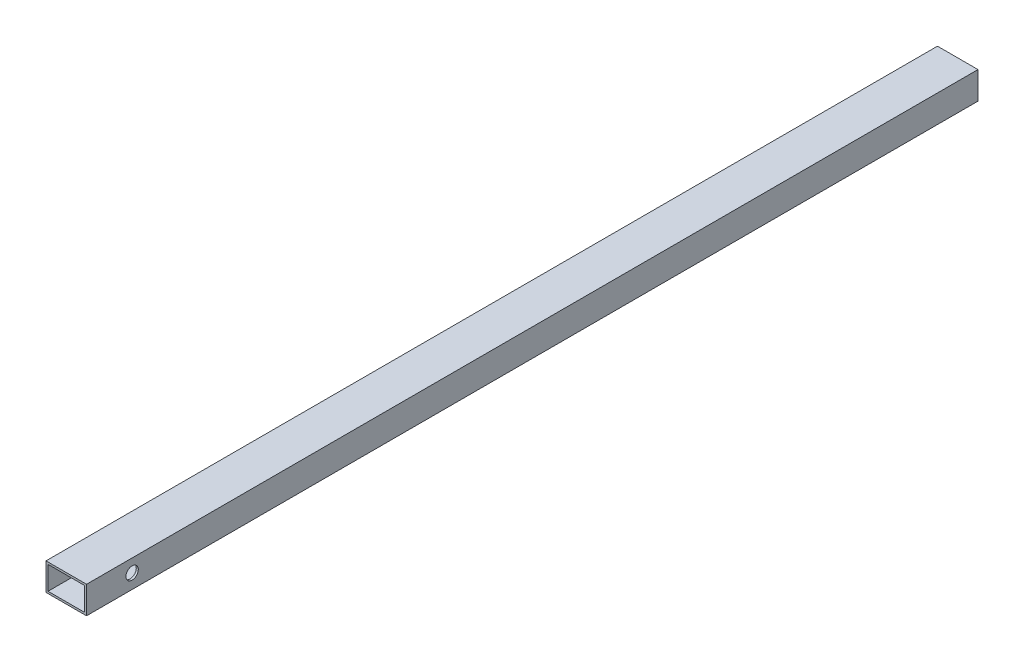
from build123d import *

# Parameters (mm, degrees)
ESQUISSE1_W             = 40
ESQUISSE1_H             = 27
ESQUISSE1_W_2           = 36
ESQUISSE1_H_2           = 23
EXTRUSION1_DEPTH        = 880
ESQUISSE2_R             = 6.1
ENL_V_MAT_EXTRU_1_DEPTH = 882.263297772


with BuildPart() as part:
    # Esquisse1 → Extrusion1 (new body)
    with BuildSketch(Plane.XY):
        with Locations((18, 11.5)):
            Rectangle(ESQUISSE1_W, ESQUISSE1_H)
        with Locations((18, 11.5)):
            Rectangle(ESQUISSE1_W_2, ESQUISSE1_H_2, mode=Mode.SUBTRACT)
    extrude(amount=EXTRUSION1_DEPTH)

    # Esquisse2 → Enl_v. mat.-Extru.1 (cut, through all)
    with BuildSketch(Plane(origin=(38, 0, 0), x_dir=(0, 0, -1), z_dir=(1, 0, 0))):
        with Locations((-835, 12.15)):
            Circle(ESQUISSE2_R)
    extrude(amount=-ENL_V_MAT_EXTRU_1_DEPTH, mode=Mode.SUBTRACT)


solid = part.part
